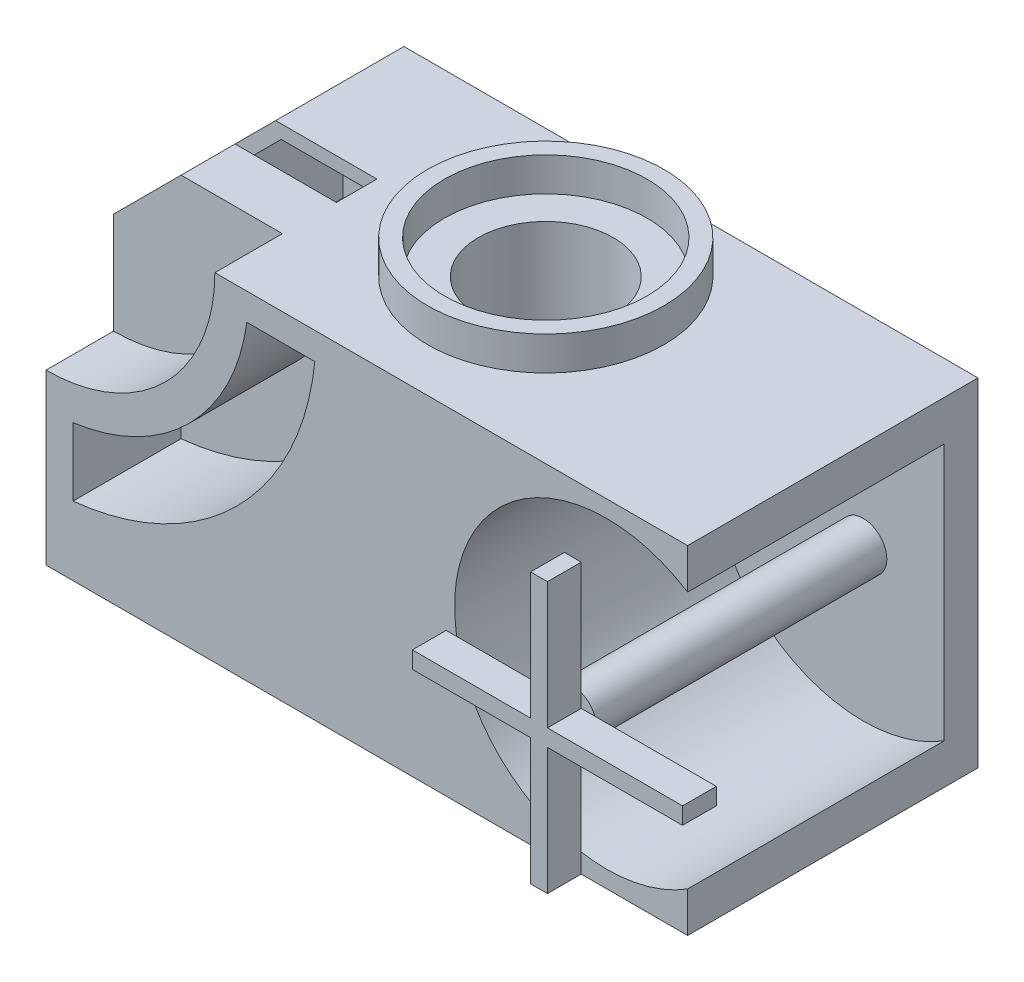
ISO-10303-21;
HEADER;
FILE_DESCRIPTION(('STEP AP214'),'2;1');
FILE_NAME('part.step','',(''),(''),'','','');
FILE_SCHEMA(('AUTOMOTIVE_DESIGN { 1 0 10303 214 1 1 1 1 }'));
ENDSEC;
DATA;
#1=APPLICATION_CONTEXT('core data for automotive mechanical design processes');
#2=APPLICATION_PROTOCOL_DEFINITION('international standard','automotive_design',2000,#1);
#3=PRODUCT_CONTEXT('',#1,'mechanical');
#4=PRODUCT('Part','Part','',(#3));
#5=PRODUCT_RELATED_PRODUCT_CATEGORY('part','',(#4));
#6=PRODUCT_DEFINITION_FORMATION('','',#4);
#7=PRODUCT_DEFINITION_CONTEXT('part definition',#1,'design');
#8=PRODUCT_DEFINITION('design','',#6,#7);
#9=PRODUCT_DEFINITION_SHAPE('','',#8);
#10=(LENGTH_UNIT() NAMED_UNIT(*) SI_UNIT(.MILLI.,.METRE.));
#11=(NAMED_UNIT(*) PLANE_ANGLE_UNIT() SI_UNIT($,.RADIAN.));
#12=(NAMED_UNIT(*) SI_UNIT($,.STERADIAN.) SOLID_ANGLE_UNIT());
#13=UNCERTAINTY_MEASURE_WITH_UNIT(LENGTH_MEASURE(1.E-05),#10,'distance_accuracy_value','');
#14=(GEOMETRIC_REPRESENTATION_CONTEXT(3) GLOBAL_UNCERTAINTY_ASSIGNED_CONTEXT((#13)) GLOBAL_UNIT_ASSIGNED_CONTEXT((#10,
#11,#12)) REPRESENTATION_CONTEXT('',''));
#15=CARTESIAN_POINT('',(0.,0.,0.));
#16=DIRECTION('',(0.,0.,1.));
#17=DIRECTION('',(1.,0.,0.));
#18=AXIS2_PLACEMENT_3D('',#15,#16,#17);
#19=CARTESIAN_POINT('',(0.,50.,144.557514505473));
#20=DIRECTION('',(0.,0.,-1.));
#21=DIRECTION('',(-1.,0.,0.));
#22=AXIS2_PLACEMENT_3D('',#19,#20,#21);
#23=CYLINDRICAL_SURFACE('',#22,25.);
#24=DIRECTION('',(0.,0.,-1.));
#25=VECTOR('',#24,1.);
#26=CARTESIAN_POINT('',(0.,25.,144.557514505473));
#27=LINE('',#26,#25);
#28=CARTESIAN_POINT('',(0.,25.,-18.));
#29=VERTEX_POINT('',#28);
#30=CARTESIAN_POINT('',(0.,25.,-24.));
#31=VERTEX_POINT('',#30);
#32=EDGE_CURVE('E323',#29,#31,#27,.T.);
#33=ORIENTED_EDGE('',*,*,#32,.F.);
#34=CARTESIAN_POINT('',(0.,50.,-18.));
#35=DIRECTION('',(0.,0.,1.));
#36=DIRECTION('',(1.,0.,0.));
#37=AXIS2_PLACEMENT_3D('',#34,#35,#36);
#38=CIRCLE('',#37,25.);
#39=CARTESIAN_POINT('',(25.,50.,-18.));
#40=VERTEX_POINT('',#39);
#41=EDGE_CURVE('E555',#29,#40,#38,.T.);
#42=ORIENTED_EDGE('',*,*,#41,.T.);
#43=DIRECTION('',(0.,0.,-1.));
#44=VECTOR('',#43,1.);
#45=CARTESIAN_POINT('',(25.,50.,144.557514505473));
#46=LINE('',#45,#44);
#47=CARTESIAN_POINT('',(25.,50.,-24.));
#48=VERTEX_POINT('',#47);
#49=EDGE_CURVE('E324',#40,#48,#46,.T.);
#50=ORIENTED_EDGE('',*,*,#49,.T.);
#51=CARTESIAN_POINT('',(0.,50.,-24.));
#52=DIRECTION('',(0.,0.,1.));
#53=DIRECTION('',(1.,0.,0.));
#54=AXIS2_PLACEMENT_3D('',#51,#52,#53);
#55=CIRCLE('',#54,25.);
#56=EDGE_CURVE('E330',#31,#48,#55,.T.);
#57=ORIENTED_EDGE('',*,*,#56,.F.);
#58=EDGE_LOOP('',(#33,#42,#50,#57));
#59=FACE_BOUND('',#58,.T.);
#60=ADVANCED_FACE('F51',(#59),#23,.F.);
#61=CARTESIAN_POINT('',(95.,50.,-43.));
#62=DIRECTION('',(0.,1.,0.));
#63=DIRECTION('',(-1.,0.,0.));
#64=AXIS2_PLACEMENT_3D('',#61,#62,#63);
#65=PLANE('',#64);
#66=CARTESIAN_POINT('',(50.,50.,-24.));
#67=DIRECTION('',(0.,1.,0.));
#68=DIRECTION('',(-1.,0.,0.));
#69=AXIS2_PLACEMENT_3D('',#66,#67,#68);
#70=CIRCLE('',#69,10.);
#71=CARTESIAN_POINT('',(40.,50.,-24.));
#72=VERTEX_POINT('',#71);
#73=EDGE_CURVE('E442',#72,#72,#70,.T.);
#74=ORIENTED_EDGE('',*,*,#73,.F.);
#75=EDGE_LOOP('',(#74));
#76=FACE_BOUND('',#75,.T.);
#77=CARTESIAN_POINT('',(50.,50.,-24.));
#78=DIRECTION('',(0.,1.,0.));
#79=DIRECTION('',(-1.,0.,0.));
#80=AXIS2_PLACEMENT_3D('',#77,#78,#79);
#81=CIRCLE('',#80,15.);
#82=CARTESIAN_POINT('',(35.,50.,-24.));
#83=VERTEX_POINT('',#82);
#84=EDGE_CURVE('E12',#83,#83,#81,.F.);
#85=ORIENTED_EDGE('',*,*,#84,.F.);
#86=EDGE_LOOP('',(#85));
#87=FACE_BOUND('',#86,.T.);
#88=ADVANCED_FACE('F807',(#76,#87),#65,.T.);
#89=CARTESIAN_POINT('',(0.,0.,5.));
#90=DIRECTION('',(0.,0.,1.));
#91=DIRECTION('',(1.,0.,0.));
#92=AXIS2_PLACEMENT_3D('',#89,#90,#91);
#93=PLANE('',#92);
#94=CARTESIAN_POINT('',(83.,25.,5.));
#95=DIRECTION('',(0.,0.,1.));
#96=DIRECTION('',(1.,0.,0.));
#97=AXIS2_PLACEMENT_3D('',#94,#95,#96);
#98=CIRCLE('',#97,3.50000000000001);
#99=CARTESIAN_POINT('',(79.7308257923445,23.75,5.));
#100=VERTEX_POINT('',#99);
#101=CARTESIAN_POINT('',(81.75,21.7308257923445,5.));
#102=VERTEX_POINT('',#101);
#103=EDGE_CURVE('E662',#100,#102,#98,.T.);
#104=ORIENTED_EDGE('',*,*,#103,.T.);
#105=DIRECTION('',(0.,1.,0.));
#106=VECTOR('',#105,1.);
#107=CARTESIAN_POINT('',(81.75,0.,5.));
#108=LINE('',#107,#106);
#109=CARTESIAN_POINT('',(81.75,23.75,5.));
#110=VERTEX_POINT('',#109);
#111=EDGE_CURVE('E61',#102,#110,#108,.T.);
#112=ORIENTED_EDGE('',*,*,#111,.T.);
#113=DIRECTION('',(-1.,0.,0.));
#114=VECTOR('',#113,1.);
#115=CARTESIAN_POINT('',(0.,23.75,5.));
#116=LINE('',#115,#114);
#117=EDGE_CURVE('E721',#110,#100,#116,.T.);
#118=ORIENTED_EDGE('',*,*,#117,.T.);
#119=EDGE_LOOP('',(#104,#112,#118));
#120=FACE_BOUND('',#119,.T.);
#121=ADVANCED_FACE('F764',(#120),#93,.T.);
#122=DIRECTION('',(-1.,0.,0.));
#123=VECTOR('',#122,1.);
#124=CARTESIAN_POINT('',(0.,26.25,5.));
#125=LINE('',#124,#123);
#126=CARTESIAN_POINT('',(81.75,26.25,5.));
#127=VERTEX_POINT('',#126);
#128=CARTESIAN_POINT('',(79.7308257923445,26.25,5.));
#129=VERTEX_POINT('',#128);
#130=EDGE_CURVE('E731',#127,#129,#125,.T.);
#131=ORIENTED_EDGE('',*,*,#130,.F.);
#132=DIRECTION('',(0.,1.,0.));
#133=VECTOR('',#132,1.);
#134=CARTESIAN_POINT('',(81.75,0.,5.));
#135=LINE('',#134,#133);
#136=CARTESIAN_POINT('',(81.75,28.2691742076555,5.));
#137=VERTEX_POINT('',#136);
#138=EDGE_CURVE('E738',#127,#137,#135,.T.);
#139=ORIENTED_EDGE('',*,*,#138,.T.);
#140=EDGE_CURVE('E657',#137,#129,#98,.T.);
#141=ORIENTED_EDGE('',*,*,#140,.T.);
#142=EDGE_LOOP('',(#131,#139,#141));
#143=FACE_BOUND('',#142,.T.);
#144=ADVANCED_FACE('F845',(#143),#93,.T.);
#145=DIRECTION('',(0.,1.,0.));
#146=VECTOR('',#145,1.);
#147=CARTESIAN_POINT('',(84.25,0.,5.));
#148=LINE('',#147,#146);
#149=CARTESIAN_POINT('',(84.25,26.25,5.));
#150=VERTEX_POINT('',#149);
#151=CARTESIAN_POINT('',(84.25,28.2691742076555,5.));
#152=VERTEX_POINT('',#151);
#153=EDGE_CURVE('E747',#150,#152,#148,.T.);
#154=ORIENTED_EDGE('',*,*,#153,.F.);
#155=DIRECTION('',(-1.,0.,0.));
#156=VECTOR('',#155,1.);
#157=CARTESIAN_POINT('',(0.,26.25,5.));
#158=LINE('',#157,#156);
#159=CARTESIAN_POINT('',(86.2691742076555,26.25,5.));
#160=VERTEX_POINT('',#159);
#161=EDGE_CURVE('E422',#160,#150,#158,.T.);
#162=ORIENTED_EDGE('',*,*,#161,.F.);
#163=EDGE_CURVE('E587',#160,#152,#98,.T.);
#164=ORIENTED_EDGE('',*,*,#163,.T.);
#165=EDGE_LOOP('',(#154,#162,#164));
#166=FACE_BOUND('',#165,.T.);
#167=ADVANCED_FACE('F841',(#166),#93,.T.);
#168=CARTESIAN_POINT('',(0.,50.,-43.));
#169=DIRECTION('',(-1.,0.,0.));
#170=DIRECTION('',(0.,0.,1.));
#171=AXIS2_PLACEMENT_3D('',#168,#169,#170);
#172=PLANE('',#171);
#173=DIRECTION('',(0.,-1.,0.));
#174=VECTOR('',#173,1.);
#175=CARTESIAN_POINT('',(0.,50.,-24.));
#176=LINE('',#175,#174);
#177=CARTESIAN_POINT('',(0.,39.9999999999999,-24.));
#178=VERTEX_POINT('',#177);
#179=EDGE_CURVE('E338',#178,#31,#176,.T.);
#180=ORIENTED_EDGE('',*,*,#179,.F.);
#181=DIRECTION('',(0.,0.,-1.));
#182=VECTOR('',#181,1.);
#183=CARTESIAN_POINT('',(0.,39.9999999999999,-43.));
#184=LINE('',#183,#182);
#185=CARTESIAN_POINT('',(0.,39.9999999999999,-43.));
#186=VERTEX_POINT('',#185);
#187=EDGE_CURVE('E392',#178,#186,#184,.T.);
#188=ORIENTED_EDGE('',*,*,#187,.T.);
#189=DIRECTION('',(0.,-1.,0.));
#190=VECTOR('',#189,1.);
#191=CARTESIAN_POINT('',(0.,50.,-43.));
#192=LINE('',#191,#190);
#193=CARTESIAN_POINT('',(0.,0.,-43.));
#194=VERTEX_POINT('',#193);
#195=EDGE_CURVE('E347',#186,#194,#192,.T.);
#196=ORIENTED_EDGE('',*,*,#195,.T.);
#197=DIRECTION('',(0.,0.,1.));
#198=VECTOR('',#197,1.);
#199=CARTESIAN_POINT('',(0.,0.,-43.));
#200=LINE('',#199,#198);
#201=CARTESIAN_POINT('',(0.,0.,0.));
#202=VERTEX_POINT('',#201);
#203=EDGE_CURVE('E361',#194,#202,#200,.T.);
#204=ORIENTED_EDGE('',*,*,#203,.T.);
#205=DIRECTION('',(0.,-1.,0.));
#206=VECTOR('',#205,1.);
#207=CARTESIAN_POINT('',(0.,50.,0.));
#208=LINE('',#207,#206);
#209=CARTESIAN_POINT('',(0.,25.,0.));
#210=VERTEX_POINT('',#209);
#211=EDGE_CURVE('E337',#210,#202,#208,.T.);
#212=ORIENTED_EDGE('',*,*,#211,.F.);
#213=CARTESIAN_POINT('',(0.,25.,-10.));
#214=VERTEX_POINT('',#213);
#215=EDGE_CURVE('E328',#210,#214,#27,.T.);
#216=ORIENTED_EDGE('',*,*,#215,.T.);
#217=DIRECTION('',(0.,-1.,0.));
#218=VECTOR('',#217,1.);
#219=CARTESIAN_POINT('',(0.,39.9999999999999,-10.));
#220=LINE('',#219,#218);
#221=CARTESIAN_POINT('',(0.,39.9999999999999,-10.));
#222=VERTEX_POINT('',#221);
#223=EDGE_CURVE('E313',#222,#214,#220,.T.);
#224=ORIENTED_EDGE('',*,*,#223,.F.);
#225=DIRECTION('',(0.,0.,-1.));
#226=VECTOR('',#225,1.);
#227=CARTESIAN_POINT('',(0.,39.9999999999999,-10.));
#228=LINE('',#227,#226);
#229=CARTESIAN_POINT('',(0.,39.9999999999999,-18.));
#230=VERTEX_POINT('',#229);
#231=EDGE_CURVE('E544',#222,#230,#228,.T.);
#232=ORIENTED_EDGE('',*,*,#231,.T.);
#233=DIRECTION('',(0.,-1.,0.));
#234=VECTOR('',#233,1.);
#235=CARTESIAN_POINT('',(0.,39.9999999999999,-18.));
#236=LINE('',#235,#234);
#237=EDGE_CURVE('E318',#230,#29,#236,.T.);
#238=ORIENTED_EDGE('',*,*,#237,.T.);
#239=ORIENTED_EDGE('',*,*,#32,.T.);
#240=EDGE_LOOP('',(#180,#188,#196,#204,#212,#216,#224,#232,#238,#239));
#241=FACE_BOUND('',#240,.T.);
#242=ADVANCED_FACE('F567',(#241),#172,.T.);
#243=CARTESIAN_POINT('',(0.,0.,0.));
#244=DIRECTION('',(0.,0.,1.));
#245=DIRECTION('',(1.,0.,0.));
#246=AXIS2_PLACEMENT_3D('',#243,#244,#245);
#247=PLANE('',#246);
#248=CARTESIAN_POINT('',(83.,25.,0.));
#249=DIRECTION('',(0.,0.,1.));
#250=DIRECTION('',(1.,0.,0.));
#251=AXIS2_PLACEMENT_3D('',#248,#249,#250);
#252=CIRCLE('',#251,22.5);
#253=CARTESIAN_POINT('',(95.,44.0328663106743,0.));
#254=VERTEX_POINT('',#253);
#255=CARTESIAN_POINT('',(95.,5.9671336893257,0.));
#256=VERTEX_POINT('',#255);
#257=EDGE_CURVE('E583',#254,#256,#252,.T.);
#258=ORIENTED_EDGE('',*,*,#257,.F.);
#259=DIRECTION('',(0.,1.,0.));
#260=VECTOR('',#259,1.);
#261=CARTESIAN_POINT('',(95.,0.,0.));
#262=LINE('',#261,#260);
#263=CARTESIAN_POINT('',(95.,50.,0.));
#264=VERTEX_POINT('',#263);
#265=EDGE_CURVE('E368',#254,#264,#262,.T.);
#266=ORIENTED_EDGE('',*,*,#265,.T.);
#267=DIRECTION('',(-1.,0.,0.));
#268=VECTOR('',#267,1.);
#269=CARTESIAN_POINT('',(95.,50.,0.));
#270=LINE('',#269,#268);
#271=CARTESIAN_POINT('',(25.,50.,0.));
#272=VERTEX_POINT('',#271);
#273=EDGE_CURVE('E351',#264,#272,#270,.T.);
#274=ORIENTED_EDGE('',*,*,#273,.T.);
#275=CARTESIAN_POINT('',(0.,50.,0.));
#276=DIRECTION('',(0.,0.,1.));
#277=DIRECTION('',(1.,0.,0.));
#278=AXIS2_PLACEMENT_3D('',#275,#276,#277);
#279=CIRCLE('',#278,25.);
#280=EDGE_CURVE('E321',#210,#272,#279,.T.);
#281=ORIENTED_EDGE('',*,*,#280,.F.);
#282=ORIENTED_EDGE('',*,*,#211,.T.);
#283=DIRECTION('',(1.,0.,0.));
#284=VECTOR('',#283,1.);
#285=CARTESIAN_POINT('',(63.639702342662,0.,0.));
#286=LINE('',#285,#284);
#287=CARTESIAN_POINT('',(95.,0.,0.));
#288=VERTEX_POINT('',#287);
#289=EDGE_CURVE('E364',#202,#288,#286,.T.);
#290=ORIENTED_EDGE('',*,*,#289,.T.);
#291=EDGE_CURVE('E369',#288,#256,#262,.T.);
#292=ORIENTED_EDGE('',*,*,#291,.T.);
#293=EDGE_LOOP('',(#258,#266,#274,#281,#282,#290,#292));
#294=FACE_BOUND('',#293,.T.);
#295=CARTESIAN_POINT('',(0.,50.,0.));
#296=DIRECTION('',(0.,0.,-1.));
#297=DIRECTION('',(1.,0.,0.));
#298=AXIS2_PLACEMENT_3D('',#295,#296,#297);
#299=CIRCLE('',#298,30.);
#300=CARTESIAN_POINT('',(29.732137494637,46.,0.));
#301=VERTEX_POINT('',#300);
#302=CARTESIAN_POINT('',(4.,20.267862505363,0.));
#303=VERTEX_POINT('',#302);
#304=EDGE_CURVE('E645',#301,#303,#299,.T.);
#305=ORIENTED_EDGE('',*,*,#304,.F.);
#306=DIRECTION('',(-1.,0.,0.));
#307=VECTOR('',#306,1.);
#308=CARTESIAN_POINT('',(29.732137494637,46.,0.));
#309=LINE('',#308,#307);
#310=CARTESIAN_POINT('',(39.7994974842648,46.,0.));
#311=VERTEX_POINT('',#310);
#312=EDGE_CURVE('E633',#311,#301,#309,.T.);
#313=ORIENTED_EDGE('',*,*,#312,.F.);
#314=CARTESIAN_POINT('',(0.,50.,0.));
#315=DIRECTION('',(0.,0.,1.));
#316=DIRECTION('',(-1.,0.,0.));
#317=AXIS2_PLACEMENT_3D('',#314,#315,#316);
#318=CIRCLE('',#317,40.);
#319=CARTESIAN_POINT('',(4.,10.2005025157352,0.));
#320=VERTEX_POINT('',#319);
#321=EDGE_CURVE('E637',#320,#311,#318,.T.);
#322=ORIENTED_EDGE('',*,*,#321,.F.);
#323=DIRECTION('',(0.,-1.,0.));
#324=VECTOR('',#323,1.);
#325=CARTESIAN_POINT('',(4.,20.267862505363,0.));
#326=LINE('',#325,#324);
#327=EDGE_CURVE('E641',#303,#320,#326,.T.);
#328=ORIENTED_EDGE('',*,*,#327,.F.);
#329=EDGE_LOOP('',(#305,#313,#322,#328));
#330=FACE_BOUND('',#329,.T.);
#331=ADVANCED_FACE('F572',(#294,#330),#247,.T.);
#332=CARTESIAN_POINT('',(50.,50.,-24.));
#333=DIRECTION('',(0.,1.,0.));
#334=DIRECTION('',(-1.,0.,0.));
#335=AXIS2_PLACEMENT_3D('',#332,#333,#334);
#336=CIRCLE('',#335,17.5);
#337=CARTESIAN_POINT('',(32.5,50.,-24.));
#338=VERTEX_POINT('',#337);
#339=EDGE_CURVE('E493',#338,#338,#336,.T.);
#340=ORIENTED_EDGE('',*,*,#339,.F.);
#341=EDGE_LOOP('',(#340));
#342=FACE_BOUND('',#341,.T.);
#343=DIRECTION('',(-1.,0.,0.));
#344=VECTOR('',#343,1.);
#345=CARTESIAN_POINT('',(95.,50.,-43.));
#346=LINE('',#345,#344);
#347=CARTESIAN_POINT('',(95.,50.,-43.));
#348=VERTEX_POINT('',#347);
#349=CARTESIAN_POINT('',(10.,50.,-43.));
#350=VERTEX_POINT('',#349);
#351=EDGE_CURVE('E358',#348,#350,#346,.T.);
#352=ORIENTED_EDGE('',*,*,#351,.T.);
#353=DIRECTION('',(0.,0.,1.));
#354=VECTOR('',#353,1.);
#355=CARTESIAN_POINT('',(10.,50.,-43.));
#356=LINE('',#355,#354);
#357=CARTESIAN_POINT('',(10.,50.,-24.));
#358=VERTEX_POINT('',#357);
#359=EDGE_CURVE('E379',#350,#358,#356,.T.);
#360=ORIENTED_EDGE('',*,*,#359,.T.);
#361=DIRECTION('',(-1.,0.,0.));
#362=VECTOR('',#361,1.);
#363=CARTESIAN_POINT('',(95.,50.,-24.));
#364=LINE('',#363,#362);
#365=EDGE_CURVE('E342',#48,#358,#364,.T.);
#366=ORIENTED_EDGE('',*,*,#365,.F.);
#367=ORIENTED_EDGE('',*,*,#49,.F.);
#368=DIRECTION('',(-1.,0.,0.));
#369=VECTOR('',#368,1.);
#370=CARTESIAN_POINT('',(25.,50.,-18.));
#371=LINE('',#370,#369);
#372=CARTESIAN_POINT('',(10.,50.,-18.));
#373=VERTEX_POINT('',#372);
#374=EDGE_CURVE('E68',#40,#373,#371,.T.);
#375=ORIENTED_EDGE('',*,*,#374,.T.);
#376=DIRECTION('',(0.,0.,-1.));
#377=VECTOR('',#376,1.);
#378=CARTESIAN_POINT('',(10.,50.,-10.));
#379=LINE('',#378,#377);
#380=CARTESIAN_POINT('',(10.,50.,-10.));
#381=VERTEX_POINT('',#380);
#382=EDGE_CURVE('E303',#381,#373,#379,.T.);
#383=ORIENTED_EDGE('',*,*,#382,.F.);
#384=DIRECTION('',(-1.,0.,0.));
#385=VECTOR('',#384,1.);
#386=CARTESIAN_POINT('',(25.,50.,-10.));
#387=LINE('',#386,#385);
#388=CARTESIAN_POINT('',(25.,50.,-10.));
#389=VERTEX_POINT('',#388);
#390=EDGE_CURVE('E294',#389,#381,#387,.T.);
#391=ORIENTED_EDGE('',*,*,#390,.F.);
#392=EDGE_CURVE('E300',#272,#389,#46,.T.);
#393=ORIENTED_EDGE('',*,*,#392,.F.);
#394=ORIENTED_EDGE('',*,*,#273,.F.);
#395=DIRECTION('',(0.,0.,1.));
#396=VECTOR('',#395,1.);
#397=CARTESIAN_POINT('',(95.,50.,-43.));
#398=LINE('',#397,#396);
#399=EDGE_CURVE('E375',#348,#264,#398,.T.);
#400=ORIENTED_EDGE('',*,*,#399,.F.);
#401=EDGE_LOOP('',(#352,#360,#366,#367,#375,#383,#391,#393,#394,#400));
#402=FACE_BOUND('',#401,.T.);
#403=ADVANCED_FACE('F297',(#342,#402),#65,.T.);
#404=CARTESIAN_POINT('',(95.,0.,-43.));
#405=DIRECTION('',(1.,0.,0.));
#406=DIRECTION('',(0.,0.,-1.));
#407=AXIS2_PLACEMENT_3D('',#404,#405,#406);
#408=PLANE('',#407);
#409=DIRECTION('',(0.,0.,1.));
#410=VECTOR('',#409,1.);
#411=CARTESIAN_POINT('',(95.,44.0328663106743,-106.639610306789));
#412=LINE('',#411,#410);
#413=CARTESIAN_POINT('',(95.,44.0328663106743,-38.));
#414=VERTEX_POINT('',#413);
#415=EDGE_CURVE('E405',#414,#254,#412,.T.);
#416=ORIENTED_EDGE('',*,*,#415,.F.);
#417=DIRECTION('',(0.,-1.,0.));
#418=VECTOR('',#417,1.);
#419=CARTESIAN_POINT('',(95.,0.,-38.));
#420=LINE('',#419,#418);
#421=CARTESIAN_POINT('',(95.,5.9671336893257,-38.));
#422=VERTEX_POINT('',#421);
#423=EDGE_CURVE('E398',#414,#422,#420,.T.);
#424=ORIENTED_EDGE('',*,*,#423,.T.);
#425=DIRECTION('',(0.,0.,1.));
#426=VECTOR('',#425,1.);
#427=CARTESIAN_POINT('',(95.,5.96713368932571,-106.639610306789));
#428=LINE('',#427,#426);
#429=EDGE_CURVE('E402',#256,#422,#428,.F.);
#430=ORIENTED_EDGE('',*,*,#429,.F.);
#431=ORIENTED_EDGE('',*,*,#291,.F.);
#432=DIRECTION('',(0.,0.,1.));
#433=VECTOR('',#432,1.);
#434=CARTESIAN_POINT('',(95.,0.,-43.));
#435=LINE('',#434,#433);
#436=CARTESIAN_POINT('',(95.,0.,-43.));
#437=VERTEX_POINT('',#436);
#438=EDGE_CURVE('E380',#437,#288,#435,.T.);
#439=ORIENTED_EDGE('',*,*,#438,.F.);
#440=DIRECTION('',(0.,1.,0.));
#441=VECTOR('',#440,1.);
#442=CARTESIAN_POINT('',(95.,0.,-43.));
#443=LINE('',#442,#441);
#444=EDGE_CURVE('E354',#437,#348,#443,.T.);
#445=ORIENTED_EDGE('',*,*,#444,.T.);
#446=ORIENTED_EDGE('',*,*,#399,.T.);
#447=ORIENTED_EDGE('',*,*,#265,.F.);
#448=EDGE_LOOP('',(#416,#424,#430,#431,#439,#445,#446,#447));
#449=FACE_BOUND('',#448,.T.);
#450=ADVANCED_FACE('F582',(#449),#408,.T.);
#451=CARTESIAN_POINT('',(63.639702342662,0.,-43.));
#452=DIRECTION('',(0.,-1.,0.));
#453=DIRECTION('',(0.,0.,-1.));
#454=AXIS2_PLACEMENT_3D('',#451,#452,#453);
#455=PLANE('',#454);
#456=CARTESIAN_POINT('',(50.,0.,-24.));
#457=DIRECTION('',(0.,1.,0.));
#458=DIRECTION('',(-1.,0.,0.));
#459=AXIS2_PLACEMENT_3D('',#456,#457,#458);
#460=CIRCLE('',#459,10.);
#461=CARTESIAN_POINT('',(40.,0.,-24.));
#462=VERTEX_POINT('',#461);
#463=EDGE_CURVE('E437',#462,#462,#460,.T.);
#464=ORIENTED_EDGE('',*,*,#463,.T.);
#465=EDGE_LOOP('',(#464));
#466=FACE_BOUND('',#465,.T.);
#467=ORIENTED_EDGE('',*,*,#289,.F.);
#468=ORIENTED_EDGE('',*,*,#203,.F.);
#469=DIRECTION('',(1.,0.,0.));
#470=VECTOR('',#469,1.);
#471=CARTESIAN_POINT('',(0.,0.,-43.));
#472=LINE('',#471,#470);
#473=EDGE_CURVE('E350',#194,#437,#472,.T.);
#474=ORIENTED_EDGE('',*,*,#473,.T.);
#475=ORIENTED_EDGE('',*,*,#438,.T.);
#476=EDGE_LOOP('',(#467,#468,#474,#475));
#477=FACE_BOUND('',#476,.T.);
#478=ADVANCED_FACE('F575',(#466,#477),#455,.T.);
#479=CARTESIAN_POINT('',(0.,0.,-43.));
#480=DIRECTION('',(0.,0.,1.));
#481=DIRECTION('',(1.,0.,0.));
#482=AXIS2_PLACEMENT_3D('',#479,#480,#481);
#483=PLANE('',#482);
#484=ORIENTED_EDGE('',*,*,#195,.F.);
#485=DIRECTION('',(-0.707106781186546,-0.707106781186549,0.));
#486=VECTOR('',#485,1.);
#487=CARTESIAN_POINT('',(10.,50.,-43.));
#488=LINE('',#487,#486);
#489=EDGE_CURVE('E395',#186,#350,#488,.F.);
#490=ORIENTED_EDGE('',*,*,#489,.T.);
#491=ORIENTED_EDGE('',*,*,#351,.F.);
#492=ORIENTED_EDGE('',*,*,#444,.F.);
#493=ORIENTED_EDGE('',*,*,#473,.F.);
#494=EDGE_LOOP('',(#484,#490,#491,#492,#493));
#495=FACE_BOUND('',#494,.T.);
#496=ADVANCED_FACE('F819',(#495),#483,.F.);
#497=CARTESIAN_POINT('',(0.,50.,-10.));
#498=DIRECTION('',(0.,0.,1.));
#499=DIRECTION('',(1.,0.,0.));
#500=AXIS2_PLACEMENT_3D('',#497,#498,#499);
#501=CIRCLE('',#500,25.);
#502=EDGE_CURVE('E308',#214,#389,#501,.T.);
#503=ORIENTED_EDGE('',*,*,#502,.F.);
#504=ORIENTED_EDGE('',*,*,#215,.F.);
#505=ORIENTED_EDGE('',*,*,#280,.T.);
#506=ORIENTED_EDGE('',*,*,#392,.T.);
#507=EDGE_LOOP('',(#503,#504,#505,#506));
#508=FACE_BOUND('',#507,.T.);
#509=ADVANCED_FACE('F320',(#508),#23,.F.);
#510=CARTESIAN_POINT('',(0.,0.,-24.));
#511=DIRECTION('',(0.,0.,1.));
#512=DIRECTION('',(1.,0.,0.));
#513=AXIS2_PLACEMENT_3D('',#510,#511,#512);
#514=PLANE('',#513);
#515=CARTESIAN_POINT('',(0.,50.,-24.));
#516=DIRECTION('',(0.,0.,1.));
#517=DIRECTION('',(1.,0.,0.));
#518=AXIS2_PLACEMENT_3D('',#515,#516,#517);
#519=CIRCLE('',#518,23.);
#520=CARTESIAN_POINT('',(2.,27.0871215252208,-24.));
#521=VERTEX_POINT('',#520);
#522=CARTESIAN_POINT('',(22.9128784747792,48.,-24.));
#523=VERTEX_POINT('',#522);
#524=EDGE_CURVE('E76',#521,#523,#519,.T.);
#525=ORIENTED_EDGE('',*,*,#524,.F.);
#526=DIRECTION('',(0.,-1.,0.));
#527=VECTOR('',#526,1.);
#528=CARTESIAN_POINT('',(2.,39.1715728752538,-24.));
#529=LINE('',#528,#527);
#530=CARTESIAN_POINT('',(2.,39.1715728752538,-24.));
#531=VERTEX_POINT('',#530);
#532=EDGE_CURVE('E512',#531,#521,#529,.T.);
#533=ORIENTED_EDGE('',*,*,#532,.F.);
#534=DIRECTION('',(-0.707106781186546,-0.707106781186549,0.));
#535=VECTOR('',#534,1.);
#536=CARTESIAN_POINT('',(10.8284271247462,48.,-24.));
#537=LINE('',#536,#535);
#538=CARTESIAN_POINT('',(10.8284271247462,48.,-24.));
#539=VERTEX_POINT('',#538);
#540=EDGE_CURVE('E525',#539,#531,#537,.T.);
#541=ORIENTED_EDGE('',*,*,#540,.F.);
#542=DIRECTION('',(-1.,0.,0.));
#543=VECTOR('',#542,1.);
#544=CARTESIAN_POINT('',(22.9128784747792,48.,-24.));
#545=LINE('',#544,#543);
#546=EDGE_CURVE('E529',#523,#539,#545,.T.);
#547=ORIENTED_EDGE('',*,*,#546,.F.);
#548=EDGE_LOOP('',(#525,#533,#541,#547));
#549=FACE_BOUND('',#548,.T.);
#550=ORIENTED_EDGE('',*,*,#365,.T.);
#551=DIRECTION('',(0.707106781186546,0.707106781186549,0.));
#552=VECTOR('',#551,1.);
#553=CARTESIAN_POINT('',(-20.,19.9999999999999,-24.));
#554=LINE('',#553,#552);
#555=EDGE_CURVE('E389',#358,#178,#554,.F.);
#556=ORIENTED_EDGE('',*,*,#555,.T.);
#557=ORIENTED_EDGE('',*,*,#179,.T.);
#558=ORIENTED_EDGE('',*,*,#56,.T.);
#559=EDGE_LOOP('',(#550,#556,#557,#558));
#560=FACE_BOUND('',#559,.T.);
#561=ADVANCED_FACE('F598',(#549,#560),#514,.T.);
#562=CARTESIAN_POINT('',(0.,50.,-16.));
#563=DIRECTION('',(0.,0.,1.));
#564=DIRECTION('',(1.,0.,0.));
#565=AXIS2_PLACEMENT_3D('',#562,#563,#564);
#566=CYLINDRICAL_SURFACE('',#565,30.);
#567=ORIENTED_EDGE('',*,*,#304,.T.);
#568=DIRECTION('',(0.,0.,1.));
#569=VECTOR('',#568,1.);
#570=CARTESIAN_POINT('',(4.,20.267862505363,-16.));
#571=LINE('',#570,#569);
#572=CARTESIAN_POINT('',(4.,20.267862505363,-16.));
#573=VERTEX_POINT('',#572);
#574=EDGE_CURVE('E614',#573,#303,#571,.T.);
#575=ORIENTED_EDGE('',*,*,#574,.F.);
#576=CARTESIAN_POINT('',(0.,50.,-16.));
#577=DIRECTION('',(0.,0.,-1.));
#578=DIRECTION('',(1.,0.,0.));
#579=AXIS2_PLACEMENT_3D('',#576,#577,#578);
#580=CIRCLE('',#579,30.);
#581=CARTESIAN_POINT('',(29.732137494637,46.,-16.));
#582=VERTEX_POINT('',#581);
#583=EDGE_CURVE('E629',#582,#573,#580,.T.);
#584=ORIENTED_EDGE('',*,*,#583,.F.);
#585=DIRECTION('',(0.,0.,1.));
#586=VECTOR('',#585,1.);
#587=CARTESIAN_POINT('',(29.732137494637,46.,-16.));
#588=LINE('',#587,#586);
#589=EDGE_CURVE('E343',#582,#301,#588,.T.);
#590=ORIENTED_EDGE('',*,*,#589,.T.);
#591=EDGE_LOOP('',(#567,#575,#584,#590));
#592=FACE_BOUND('',#591,.T.);
#593=ADVANCED_FACE('F825',(#592),#566,.T.);
#594=CARTESIAN_POINT('',(29.732137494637,46.,-16.));
#595=DIRECTION('',(0.,1.,0.));
#596=DIRECTION('',(0.,0.,1.));
#597=AXIS2_PLACEMENT_3D('',#594,#595,#596);
#598=PLANE('',#597);
#599=ORIENTED_EDGE('',*,*,#312,.T.);
#600=ORIENTED_EDGE('',*,*,#589,.F.);
#601=DIRECTION('',(-1.,0.,0.));
#602=VECTOR('',#601,1.);
#603=CARTESIAN_POINT('',(29.732137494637,46.,-16.));
#604=LINE('',#603,#602);
#605=CARTESIAN_POINT('',(39.7994974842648,46.,-16.));
#606=VERTEX_POINT('',#605);
#607=EDGE_CURVE('E618',#606,#582,#604,.T.);
#608=ORIENTED_EDGE('',*,*,#607,.F.);
#609=DIRECTION('',(0.,0.,1.));
#610=VECTOR('',#609,1.);
#611=CARTESIAN_POINT('',(39.7994974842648,46.,-16.));
#612=LINE('',#611,#610);
#613=EDGE_CURVE('E608',#606,#311,#612,.T.);
#614=ORIENTED_EDGE('',*,*,#613,.T.);
#615=EDGE_LOOP('',(#599,#600,#608,#614));
#616=FACE_BOUND('',#615,.T.);
#617=ADVANCED_FACE('F942',(#616),#598,.F.);
#618=CARTESIAN_POINT('',(0.,50.,-16.));
#619=DIRECTION('',(0.,0.,1.));
#620=DIRECTION('',(1.,0.,0.));
#621=AXIS2_PLACEMENT_3D('',#618,#619,#620);
#622=CYLINDRICAL_SURFACE('',#621,40.);
#623=ORIENTED_EDGE('',*,*,#321,.T.);
#624=ORIENTED_EDGE('',*,*,#613,.F.);
#625=CARTESIAN_POINT('',(0.,50.,-16.));
#626=DIRECTION('',(0.,0.,1.));
#627=DIRECTION('',(-1.,0.,0.));
#628=AXIS2_PLACEMENT_3D('',#625,#626,#627);
#629=CIRCLE('',#628,40.);
#630=CARTESIAN_POINT('',(4.,10.2005025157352,-16.));
#631=VERTEX_POINT('',#630);
#632=EDGE_CURVE('E621',#631,#606,#629,.T.);
#633=ORIENTED_EDGE('',*,*,#632,.F.);
#634=DIRECTION('',(0.,0.,1.));
#635=VECTOR('',#634,1.);
#636=CARTESIAN_POINT('',(4.,10.2005025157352,-16.));
#637=LINE('',#636,#635);
#638=EDGE_CURVE('E611',#631,#320,#637,.T.);
#639=ORIENTED_EDGE('',*,*,#638,.T.);
#640=EDGE_LOOP('',(#623,#624,#633,#639));
#641=FACE_BOUND('',#640,.T.);
#642=ADVANCED_FACE('F932',(#641),#622,.F.);
#643=CARTESIAN_POINT('',(4.,20.267862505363,-16.));
#644=DIRECTION('',(-1.,0.,0.));
#645=DIRECTION('',(0.,-1.,0.));
#646=AXIS2_PLACEMENT_3D('',#643,#644,#645);
#647=PLANE('',#646);
#648=ORIENTED_EDGE('',*,*,#327,.T.);
#649=ORIENTED_EDGE('',*,*,#638,.F.);
#650=DIRECTION('',(0.,-1.,0.));
#651=VECTOR('',#650,1.);
#652=CARTESIAN_POINT('',(4.,20.267862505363,-16.));
#653=LINE('',#652,#651);
#654=EDGE_CURVE('E625',#573,#631,#653,.T.);
#655=ORIENTED_EDGE('',*,*,#654,.F.);
#656=ORIENTED_EDGE('',*,*,#574,.T.);
#657=EDGE_LOOP('',(#648,#649,#655,#656));
#658=FACE_BOUND('',#657,.T.);
#659=ADVANCED_FACE('F922',(#658),#647,.F.);
#660=CARTESIAN_POINT('',(0.,50.,-16.));
#661=DIRECTION('',(0.,0.,1.));
#662=DIRECTION('',(1.,0.,0.));
#663=AXIS2_PLACEMENT_3D('',#660,#661,#662);
#664=PLANE('',#663);
#665=ORIENTED_EDGE('',*,*,#583,.T.);
#666=ORIENTED_EDGE('',*,*,#654,.T.);
#667=ORIENTED_EDGE('',*,*,#632,.T.);
#668=ORIENTED_EDGE('',*,*,#607,.T.);
#669=EDGE_LOOP('',(#665,#666,#667,#668));
#670=FACE_BOUND('',#669,.T.);
#671=ADVANCED_FACE('F915',(#670),#664,.T.);
#672=CARTESIAN_POINT('',(10.,50.,-43.));
#673=DIRECTION('',(0.707106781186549,-0.707106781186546,0.));
#674=DIRECTION('',(0.,0.,1.));
#675=AXIS2_PLACEMENT_3D('',#672,#673,#674);
#676=PLANE('',#675);
#677=ORIENTED_EDGE('',*,*,#489,.F.);
#678=ORIENTED_EDGE('',*,*,#187,.F.);
#679=ORIENTED_EDGE('',*,*,#555,.F.);
#680=ORIENTED_EDGE('',*,*,#359,.F.);
#681=EDGE_LOOP('',(#677,#678,#679,#680));
#682=FACE_BOUND('',#681,.T.);
#683=ADVANCED_FACE('F54',(#682),#676,.F.);
#684=CARTESIAN_POINT('',(83.,25.,-106.639610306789));
#685=DIRECTION('',(0.,0.,1.));
#686=DIRECTION('',(1.,0.,0.));
#687=AXIS2_PLACEMENT_3D('',#684,#685,#686);
#688=CYLINDRICAL_SURFACE('',#687,22.5);
#689=ORIENTED_EDGE('',*,*,#415,.T.);
#690=ORIENTED_EDGE('',*,*,#257,.T.);
#691=ORIENTED_EDGE('',*,*,#429,.T.);
#692=CARTESIAN_POINT('',(83.,25.,-38.));
#693=DIRECTION('',(0.,0.,1.));
#694=DIRECTION('',(1.,0.,0.));
#695=AXIS2_PLACEMENT_3D('',#692,#693,#694);
#696=CIRCLE('',#695,22.5);
#697=EDGE_CURVE('E586',#422,#414,#696,.F.);
#698=ORIENTED_EDGE('',*,*,#697,.T.);
#699=EDGE_LOOP('',(#689,#690,#691,#698));
#700=FACE_BOUND('',#699,.T.);
#701=ADVANCED_FACE('F901',(#700),#688,.F.);
#702=CARTESIAN_POINT('',(0.,0.,-38.));
#703=DIRECTION('',(0.,0.,1.));
#704=DIRECTION('',(1.,0.,0.));
#705=AXIS2_PLACEMENT_3D('',#702,#703,#704);
#706=PLANE('',#705);
#707=CARTESIAN_POINT('',(83.,25.,-38.));
#708=DIRECTION('',(0.,0.,1.));
#709=DIRECTION('',(1.,0.,0.));
#710=AXIS2_PLACEMENT_3D('',#707,#708,#709);
#711=CIRCLE('',#710,3.50000000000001);
#712=CARTESIAN_POINT('',(86.5,25.,-38.));
#713=VERTEX_POINT('',#712);
#714=EDGE_CURVE('E670',#713,#713,#711,.T.);
#715=ORIENTED_EDGE('',*,*,#714,.F.);
#716=EDGE_LOOP('',(#715));
#717=FACE_BOUND('',#716,.T.);
#718=ORIENTED_EDGE('',*,*,#697,.F.);
#719=ORIENTED_EDGE('',*,*,#423,.F.);
#720=EDGE_LOOP('',(#718,#719));
#721=FACE_BOUND('',#720,.T.);
#722=ADVANCED_FACE('F864',(#717,#721),#706,.T.);
#723=CARTESIAN_POINT('',(83.,25.,19.8994949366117));
#724=DIRECTION('',(0.,0.,-1.));
#725=DIRECTION('',(-1.,0.,0.));
#726=AXIS2_PLACEMENT_3D('',#723,#724,#725);
#727=CYLINDRICAL_SURFACE('',#726,3.50000000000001);
#728=ORIENTED_EDGE('',*,*,#714,.T.);
#729=EDGE_LOOP('',(#728));
#730=FACE_BOUND('',#729,.T.);
#731=ORIENTED_EDGE('',*,*,#163,.F.);
#732=CARTESIAN_POINT('',(86.2691742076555,23.75,5.));
#733=VERTEX_POINT('',#732);
#734=EDGE_CURVE('E655',#733,#160,#98,.T.);
#735=ORIENTED_EDGE('',*,*,#734,.F.);
#736=CARTESIAN_POINT('',(84.25,21.7308257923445,5.));
#737=VERTEX_POINT('',#736);
#738=EDGE_CURVE('E667',#737,#733,#98,.T.);
#739=ORIENTED_EDGE('',*,*,#738,.F.);
#740=EDGE_CURVE('E665',#102,#737,#98,.T.);
#741=ORIENTED_EDGE('',*,*,#740,.F.);
#742=ORIENTED_EDGE('',*,*,#103,.F.);
#743=EDGE_CURVE('E660',#129,#100,#98,.T.);
#744=ORIENTED_EDGE('',*,*,#743,.F.);
#745=ORIENTED_EDGE('',*,*,#140,.F.);
#746=EDGE_CURVE('E653',#152,#137,#98,.T.);
#747=ORIENTED_EDGE('',*,*,#746,.F.);
#748=EDGE_LOOP('',(#731,#735,#739,#741,#742,#744,#745,#747));
#749=FACE_BOUND('',#748,.T.);
#750=ADVANCED_FACE('F777',(#730,#749),#727,.T.);
#751=DIRECTION('',(0.,1.,0.));
#752=VECTOR('',#751,1.);
#753=CARTESIAN_POINT('',(84.25,0.,5.));
#754=LINE('',#753,#752);
#755=CARTESIAN_POINT('',(84.25,23.75,5.));
#756=VERTEX_POINT('',#755);
#757=EDGE_CURVE('E414',#737,#756,#754,.T.);
#758=ORIENTED_EDGE('',*,*,#757,.F.);
#759=ORIENTED_EDGE('',*,*,#738,.T.);
#760=DIRECTION('',(-1.,0.,0.));
#761=VECTOR('',#760,1.);
#762=CARTESIAN_POINT('',(0.,23.75,5.));
#763=LINE('',#762,#761);
#764=EDGE_CURVE('E407',#733,#756,#763,.T.);
#765=ORIENTED_EDGE('',*,*,#764,.T.);
#766=EDGE_LOOP('',(#758,#759,#765));
#767=FACE_BOUND('',#766,.T.);
#768=ADVANCED_FACE('F779',(#767),#93,.T.);
#769=CARTESIAN_POINT('',(0.,0.,5.));
#770=DIRECTION('',(0.,0.,1.));
#771=DIRECTION('',(1.,0.,0.));
#772=AXIS2_PLACEMENT_3D('',#769,#770,#771);
#773=PLANE('',#772);
#774=CARTESIAN_POINT('',(84.25,45.,5.));
#775=VERTEX_POINT('',#774);
#776=EDGE_CURVE('E751',#152,#775,#148,.T.);
#777=ORIENTED_EDGE('',*,*,#776,.F.);
#778=ORIENTED_EDGE('',*,*,#746,.T.);
#779=CARTESIAN_POINT('',(81.75,45.,5.));
#780=VERTEX_POINT('',#779);
#781=EDGE_CURVE('E741',#137,#780,#135,.T.);
#782=ORIENTED_EDGE('',*,*,#781,.T.);
#783=DIRECTION('',(-1.,0.,0.));
#784=VECTOR('',#783,1.);
#785=CARTESIAN_POINT('',(0.,45.,5.));
#786=LINE('',#785,#784);
#787=EDGE_CURVE('E744',#775,#780,#786,.T.);
#788=ORIENTED_EDGE('',*,*,#787,.F.);
#789=EDGE_LOOP('',(#777,#778,#782,#788));
#790=FACE_BOUND('',#789,.T.);
#791=ADVANCED_FACE('F857',(#790),#773,.F.);
#792=CARTESIAN_POINT('',(64.25,26.25,5.));
#793=VERTEX_POINT('',#792);
#794=EDGE_CURVE('E735',#129,#793,#125,.T.);
#795=ORIENTED_EDGE('',*,*,#794,.F.);
#796=ORIENTED_EDGE('',*,*,#743,.T.);
#797=CARTESIAN_POINT('',(64.25,23.75,5.));
#798=VERTEX_POINT('',#797);
#799=EDGE_CURVE('E725',#100,#798,#116,.T.);
#800=ORIENTED_EDGE('',*,*,#799,.T.);
#801=DIRECTION('',(0.,1.,0.));
#802=VECTOR('',#801,1.);
#803=CARTESIAN_POINT('',(64.25,0.,5.));
#804=LINE('',#803,#802);
#805=EDGE_CURVE('E728',#798,#793,#804,.T.);
#806=ORIENTED_EDGE('',*,*,#805,.T.);
#807=EDGE_LOOP('',(#795,#796,#800,#806));
#808=FACE_BOUND('',#807,.T.);
#809=ADVANCED_FACE('F861',(#808),#773,.F.);
#810=CARTESIAN_POINT('',(81.75,5.,5.));
#811=VERTEX_POINT('',#810);
#812=EDGE_CURVE('E717',#811,#102,#108,.T.);
#813=ORIENTED_EDGE('',*,*,#812,.T.);
#814=ORIENTED_EDGE('',*,*,#740,.T.);
#815=CARTESIAN_POINT('',(84.25,5.,5.));
#816=VERTEX_POINT('',#815);
#817=EDGE_CURVE('E424',#816,#737,#754,.T.);
#818=ORIENTED_EDGE('',*,*,#817,.F.);
#819=DIRECTION('',(-1.,0.,0.));
#820=VECTOR('',#819,1.);
#821=CARTESIAN_POINT('',(0.,4.99999999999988,5.));
#822=LINE('',#821,#820);
#823=EDGE_CURVE('E488',#816,#811,#822,.T.);
#824=ORIENTED_EDGE('',*,*,#823,.T.);
#825=EDGE_LOOP('',(#813,#814,#818,#824));
#826=FACE_BOUND('',#825,.T.);
#827=ADVANCED_FACE('F772',(#826),#773,.F.);
#828=CARTESIAN_POINT('',(104.25,23.75,5.));
#829=VERTEX_POINT('',#828);
#830=EDGE_CURVE('E416',#829,#733,#763,.T.);
#831=ORIENTED_EDGE('',*,*,#830,.T.);
#832=ORIENTED_EDGE('',*,*,#734,.T.);
#833=CARTESIAN_POINT('',(104.25,26.25,5.));
#834=VERTEX_POINT('',#833);
#835=EDGE_CURVE('E435',#834,#160,#158,.T.);
#836=ORIENTED_EDGE('',*,*,#835,.F.);
#837=DIRECTION('',(0.,1.,0.));
#838=VECTOR('',#837,1.);
#839=CARTESIAN_POINT('',(104.25,0.,5.));
#840=LINE('',#839,#838);
#841=EDGE_CURVE('E428',#829,#834,#840,.T.);
#842=ORIENTED_EDGE('',*,*,#841,.F.);
#843=EDGE_LOOP('',(#831,#832,#836,#842));
#844=FACE_BOUND('',#843,.T.);
#845=ADVANCED_FACE('F863',(#844),#773,.F.);
#846=CARTESIAN_POINT('',(84.25,0.,10.));
#847=DIRECTION('',(-1.,0.,0.));
#848=DIRECTION('',(0.,-1.,0.));
#849=AXIS2_PLACEMENT_3D('',#846,#847,#848);
#850=PLANE('',#849);
#851=ORIENTED_EDGE('',*,*,#817,.T.);
#852=ORIENTED_EDGE('',*,*,#757,.T.);
#853=DIRECTION('',(0.,0.,-1.));
#854=VECTOR('',#853,1.);
#855=CARTESIAN_POINT('',(84.25,23.75,10.));
#856=LINE('',#855,#854);
#857=CARTESIAN_POINT('',(84.25,23.75,10.));
#858=VERTEX_POINT('',#857);
#859=EDGE_CURVE('E673',#858,#756,#856,.T.);
#860=ORIENTED_EDGE('',*,*,#859,.F.);
#861=DIRECTION('',(0.,1.,0.));
#862=VECTOR('',#861,1.);
#863=CARTESIAN_POINT('',(84.25,0.,10.));
#864=LINE('',#863,#862);
#865=CARTESIAN_POINT('',(84.25,5.,10.));
#866=VERTEX_POINT('',#865);
#867=EDGE_CURVE('E485',#866,#858,#864,.T.);
#868=ORIENTED_EDGE('',*,*,#867,.F.);
#869=DIRECTION('',(0.,0.,-1.));
#870=VECTOR('',#869,1.);
#871=CARTESIAN_POINT('',(84.25,5.,10.));
#872=LINE('',#871,#870);
#873=EDGE_CURVE('E449',#866,#816,#872,.T.);
#874=ORIENTED_EDGE('',*,*,#873,.T.);
#875=EDGE_LOOP('',(#851,#852,#860,#868,#874));
#876=FACE_BOUND('',#875,.T.);
#877=ADVANCED_FACE('F781',(#876),#850,.F.);
#878=CARTESIAN_POINT('',(0.,23.75,10.));
#879=DIRECTION('',(0.,-1.,0.));
#880=DIRECTION('',(1.,0.,0.));
#881=AXIS2_PLACEMENT_3D('',#878,#879,#880);
#882=PLANE('',#881);
#883=ORIENTED_EDGE('',*,*,#830,.F.);
#884=DIRECTION('',(0.,0.,-1.));
#885=VECTOR('',#884,1.);
#886=CARTESIAN_POINT('',(104.25,23.75,10.));
#887=LINE('',#886,#885);
#888=CARTESIAN_POINT('',(104.25,23.75,10.));
#889=VERTEX_POINT('',#888);
#890=EDGE_CURVE('E676',#889,#829,#887,.T.);
#891=ORIENTED_EDGE('',*,*,#890,.F.);
#892=DIRECTION('',(-1.,0.,0.));
#893=VECTOR('',#892,1.);
#894=CARTESIAN_POINT('',(0.,23.75,10.));
#895=LINE('',#894,#893);
#896=EDGE_CURVE('E481',#889,#858,#895,.T.);
#897=ORIENTED_EDGE('',*,*,#896,.T.);
#898=ORIENTED_EDGE('',*,*,#859,.T.);
#899=ORIENTED_EDGE('',*,*,#764,.F.);
#900=EDGE_LOOP('',(#883,#891,#897,#898,#899));
#901=FACE_BOUND('',#900,.T.);
#902=ADVANCED_FACE('F786',(#901),#882,.T.);
#903=CARTESIAN_POINT('',(104.25,0.,10.));
#904=DIRECTION('',(-1.,0.,0.));
#905=DIRECTION('',(0.,0.,1.));
#906=AXIS2_PLACEMENT_3D('',#903,#904,#905);
#907=PLANE('',#906);
#908=ORIENTED_EDGE('',*,*,#841,.T.);
#909=DIRECTION('',(0.,0.,-1.));
#910=VECTOR('',#909,1.);
#911=CARTESIAN_POINT('',(104.25,26.25,10.));
#912=LINE('',#911,#910);
#913=CARTESIAN_POINT('',(104.25,26.25,10.));
#914=VERTEX_POINT('',#913);
#915=EDGE_CURVE('E679',#914,#834,#912,.T.);
#916=ORIENTED_EDGE('',*,*,#915,.F.);
#917=DIRECTION('',(0.,1.,0.));
#918=VECTOR('',#917,1.);
#919=CARTESIAN_POINT('',(104.25,0.,10.));
#920=LINE('',#919,#918);
#921=EDGE_CURVE('E478',#889,#914,#920,.T.);
#922=ORIENTED_EDGE('',*,*,#921,.F.);
#923=ORIENTED_EDGE('',*,*,#890,.T.);
#924=EDGE_LOOP('',(#908,#916,#922,#923));
#925=FACE_BOUND('',#924,.T.);
#926=ADVANCED_FACE('F1229',(#925),#907,.F.);
#927=CARTESIAN_POINT('',(0.,26.25,10.));
#928=DIRECTION('',(0.,-1.,0.));
#929=DIRECTION('',(1.,0.,0.));
#930=AXIS2_PLACEMENT_3D('',#927,#928,#929);
#931=PLANE('',#930);
#932=ORIENTED_EDGE('',*,*,#835,.T.);
#933=ORIENTED_EDGE('',*,*,#161,.T.);
#934=DIRECTION('',(0.,0.,-1.));
#935=VECTOR('',#934,1.);
#936=CARTESIAN_POINT('',(84.25,26.25,10.));
#937=LINE('',#936,#935);
#938=CARTESIAN_POINT('',(84.25,26.25,10.));
#939=VERTEX_POINT('',#938);
#940=EDGE_CURVE('E683',#939,#150,#937,.T.);
#941=ORIENTED_EDGE('',*,*,#940,.F.);
#942=DIRECTION('',(-1.,0.,0.));
#943=VECTOR('',#942,1.);
#944=CARTESIAN_POINT('',(0.,26.25,10.));
#945=LINE('',#944,#943);
#946=EDGE_CURVE('E475',#914,#939,#945,.T.);
#947=ORIENTED_EDGE('',*,*,#946,.F.);
#948=ORIENTED_EDGE('',*,*,#915,.T.);
#949=EDGE_LOOP('',(#932,#933,#941,#947,#948));
#950=FACE_BOUND('',#949,.T.);
#951=ADVANCED_FACE('F1220',(#950),#931,.F.);
#952=CARTESIAN_POINT('',(84.25,0.,10.));
#953=DIRECTION('',(-1.,0.,0.));
#954=DIRECTION('',(0.,-1.,0.));
#955=AXIS2_PLACEMENT_3D('',#952,#953,#954);
#956=PLANE('',#955);
#957=ORIENTED_EDGE('',*,*,#153,.T.);
#958=ORIENTED_EDGE('',*,*,#776,.T.);
#959=DIRECTION('',(0.,0.,-1.));
#960=VECTOR('',#959,1.);
#961=CARTESIAN_POINT('',(84.25,45.,10.));
#962=LINE('',#961,#960);
#963=CARTESIAN_POINT('',(84.25,45.,10.));
#964=VERTEX_POINT('',#963);
#965=EDGE_CURVE('E687',#964,#775,#962,.T.);
#966=ORIENTED_EDGE('',*,*,#965,.F.);
#967=DIRECTION('',(0.,1.,0.));
#968=VECTOR('',#967,1.);
#969=CARTESIAN_POINT('',(84.25,0.,10.));
#970=LINE('',#969,#968);
#971=EDGE_CURVE('E472',#939,#964,#970,.T.);
#972=ORIENTED_EDGE('',*,*,#971,.F.);
#973=ORIENTED_EDGE('',*,*,#940,.T.);
#974=EDGE_LOOP('',(#957,#958,#966,#972,#973));
#975=FACE_BOUND('',#974,.T.);
#976=ADVANCED_FACE('F1211',(#975),#956,.F.);
#977=CARTESIAN_POINT('',(0.,45.,10.));
#978=DIRECTION('',(0.,-1.,0.));
#979=DIRECTION('',(0.,0.,-1.));
#980=AXIS2_PLACEMENT_3D('',#977,#978,#979);
#981=PLANE('',#980);
#982=ORIENTED_EDGE('',*,*,#787,.T.);
#983=DIRECTION('',(0.,0.,-1.));
#984=VECTOR('',#983,1.);
#985=CARTESIAN_POINT('',(81.75,45.,10.));
#986=LINE('',#985,#984);
#987=CARTESIAN_POINT('',(81.75,45.,10.));
#988=VERTEX_POINT('',#987);
#989=EDGE_CURVE('E691',#988,#780,#986,.T.);
#990=ORIENTED_EDGE('',*,*,#989,.F.);
#991=DIRECTION('',(-1.,0.,0.));
#992=VECTOR('',#991,1.);
#993=CARTESIAN_POINT('',(0.,45.,10.));
#994=LINE('',#993,#992);
#995=EDGE_CURVE('E469',#964,#988,#994,.T.);
#996=ORIENTED_EDGE('',*,*,#995,.F.);
#997=ORIENTED_EDGE('',*,*,#965,.T.);
#998=EDGE_LOOP('',(#982,#990,#996,#997));
#999=FACE_BOUND('',#998,.T.);
#1000=ADVANCED_FACE('F1202',(#999),#981,.F.);
#1001=CARTESIAN_POINT('',(81.75,0.,10.));
#1002=DIRECTION('',(-1.,0.,0.));
#1003=DIRECTION('',(0.,-1.,0.));
#1004=AXIS2_PLACEMENT_3D('',#1001,#1002,#1003);
#1005=PLANE('',#1004);
#1006=ORIENTED_EDGE('',*,*,#138,.F.);
#1007=DIRECTION('',(0.,0.,-1.));
#1008=VECTOR('',#1007,1.);
#1009=CARTESIAN_POINT('',(81.75,26.25,10.));
#1010=LINE('',#1009,#1008);
#1011=CARTESIAN_POINT('',(81.75,26.25,10.));
#1012=VERTEX_POINT('',#1011);
#1013=EDGE_CURVE('E695',#1012,#127,#1010,.T.);
#1014=ORIENTED_EDGE('',*,*,#1013,.F.);
#1015=DIRECTION('',(0.,1.,0.));
#1016=VECTOR('',#1015,1.);
#1017=CARTESIAN_POINT('',(81.75,0.,10.));
#1018=LINE('',#1017,#1016);
#1019=EDGE_CURVE('E465',#1012,#988,#1018,.T.);
#1020=ORIENTED_EDGE('',*,*,#1019,.T.);
#1021=ORIENTED_EDGE('',*,*,#989,.T.);
#1022=ORIENTED_EDGE('',*,*,#781,.F.);
#1023=EDGE_LOOP('',(#1006,#1014,#1020,#1021,#1022));
#1024=FACE_BOUND('',#1023,.T.);
#1025=ADVANCED_FACE('F1193',(#1024),#1005,.T.);
#1026=CARTESIAN_POINT('',(0.,26.25,10.));
#1027=DIRECTION('',(0.,-1.,0.));
#1028=DIRECTION('',(1.,0.,0.));
#1029=AXIS2_PLACEMENT_3D('',#1026,#1027,#1028);
#1030=PLANE('',#1029);
#1031=ORIENTED_EDGE('',*,*,#130,.T.);
#1032=ORIENTED_EDGE('',*,*,#794,.T.);
#1033=DIRECTION('',(0.,0.,-1.));
#1034=VECTOR('',#1033,1.);
#1035=CARTESIAN_POINT('',(64.25,26.25,10.));
#1036=LINE('',#1035,#1034);
#1037=CARTESIAN_POINT('',(64.25,26.25,10.));
#1038=VERTEX_POINT('',#1037);
#1039=EDGE_CURVE('E698',#1038,#793,#1036,.T.);
#1040=ORIENTED_EDGE('',*,*,#1039,.F.);
#1041=DIRECTION('',(-1.,0.,0.));
#1042=VECTOR('',#1041,1.);
#1043=CARTESIAN_POINT('',(0.,26.25,10.));
#1044=LINE('',#1043,#1042);
#1045=EDGE_CURVE('E462',#1012,#1038,#1044,.T.);
#1046=ORIENTED_EDGE('',*,*,#1045,.F.);
#1047=ORIENTED_EDGE('',*,*,#1013,.T.);
#1048=EDGE_LOOP('',(#1031,#1032,#1040,#1046,#1047));
#1049=FACE_BOUND('',#1048,.T.);
#1050=ADVANCED_FACE('F1184',(#1049),#1030,.F.);
#1051=CARTESIAN_POINT('',(64.25,0.,10.));
#1052=DIRECTION('',(-1.,0.,0.));
#1053=DIRECTION('',(0.,0.,1.));
#1054=AXIS2_PLACEMENT_3D('',#1051,#1052,#1053);
#1055=PLANE('',#1054);
#1056=ORIENTED_EDGE('',*,*,#805,.F.);
#1057=DIRECTION('',(0.,0.,-1.));
#1058=VECTOR('',#1057,1.);
#1059=CARTESIAN_POINT('',(64.25,23.75,10.));
#1060=LINE('',#1059,#1058);
#1061=CARTESIAN_POINT('',(64.25,23.75,10.));
#1062=VERTEX_POINT('',#1061);
#1063=EDGE_CURVE('E702',#1062,#798,#1060,.T.);
#1064=ORIENTED_EDGE('',*,*,#1063,.F.);
#1065=DIRECTION('',(0.,1.,0.));
#1066=VECTOR('',#1065,1.);
#1067=CARTESIAN_POINT('',(64.25,0.,10.));
#1068=LINE('',#1067,#1066);
#1069=EDGE_CURVE('E458',#1062,#1038,#1068,.T.);
#1070=ORIENTED_EDGE('',*,*,#1069,.T.);
#1071=ORIENTED_EDGE('',*,*,#1039,.T.);
#1072=EDGE_LOOP('',(#1056,#1064,#1070,#1071));
#1073=FACE_BOUND('',#1072,.T.);
#1074=ADVANCED_FACE('F1175',(#1073),#1055,.T.);
#1075=CARTESIAN_POINT('',(0.,23.75,10.));
#1076=DIRECTION('',(0.,-1.,0.));
#1077=DIRECTION('',(1.,0.,0.));
#1078=AXIS2_PLACEMENT_3D('',#1075,#1076,#1077);
#1079=PLANE('',#1078);
#1080=ORIENTED_EDGE('',*,*,#117,.F.);
#1081=DIRECTION('',(0.,0.,-1.));
#1082=VECTOR('',#1081,1.);
#1083=CARTESIAN_POINT('',(81.75,23.75,10.));
#1084=LINE('',#1083,#1082);
#1085=CARTESIAN_POINT('',(81.75,23.75,10.));
#1086=VERTEX_POINT('',#1085);
#1087=EDGE_CURVE('E706',#1086,#110,#1084,.T.);
#1088=ORIENTED_EDGE('',*,*,#1087,.F.);
#1089=DIRECTION('',(-1.,0.,0.));
#1090=VECTOR('',#1089,1.);
#1091=CARTESIAN_POINT('',(0.,23.75,10.));
#1092=LINE('',#1091,#1090);
#1093=EDGE_CURVE('E454',#1086,#1062,#1092,.T.);
#1094=ORIENTED_EDGE('',*,*,#1093,.T.);
#1095=ORIENTED_EDGE('',*,*,#1063,.T.);
#1096=ORIENTED_EDGE('',*,*,#799,.F.);
#1097=EDGE_LOOP('',(#1080,#1088,#1094,#1095,#1096));
#1098=FACE_BOUND('',#1097,.T.);
#1099=ADVANCED_FACE('F803',(#1098),#1079,.T.);
#1100=CARTESIAN_POINT('',(81.75,0.,10.));
#1101=DIRECTION('',(-1.,0.,0.));
#1102=DIRECTION('',(0.,-1.,0.));
#1103=AXIS2_PLACEMENT_3D('',#1100,#1101,#1102);
#1104=PLANE('',#1103);
#1105=ORIENTED_EDGE('',*,*,#812,.F.);
#1106=DIRECTION('',(0.,0.,-1.));
#1107=VECTOR('',#1106,1.);
#1108=CARTESIAN_POINT('',(81.75,5.,10.));
#1109=LINE('',#1108,#1107);
#1110=CARTESIAN_POINT('',(81.75,5.,10.));
#1111=VERTEX_POINT('',#1110);
#1112=EDGE_CURVE('E709',#1111,#811,#1109,.T.);
#1113=ORIENTED_EDGE('',*,*,#1112,.F.);
#1114=DIRECTION('',(0.,1.,0.));
#1115=VECTOR('',#1114,1.);
#1116=CARTESIAN_POINT('',(81.75,0.,10.));
#1117=LINE('',#1116,#1115);
#1118=EDGE_CURVE('E450',#1111,#1086,#1117,.T.);
#1119=ORIENTED_EDGE('',*,*,#1118,.T.);
#1120=ORIENTED_EDGE('',*,*,#1087,.T.);
#1121=ORIENTED_EDGE('',*,*,#111,.F.);
#1122=EDGE_LOOP('',(#1105,#1113,#1119,#1120,#1121));
#1123=FACE_BOUND('',#1122,.T.);
#1124=ADVANCED_FACE('F769',(#1123),#1104,.T.);
#1125=CARTESIAN_POINT('',(0.,4.99999999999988,10.));
#1126=DIRECTION('',(0.,-1.,0.));
#1127=DIRECTION('',(1.,0.,0.));
#1128=AXIS2_PLACEMENT_3D('',#1125,#1126,#1127);
#1129=PLANE('',#1128);
#1130=ORIENTED_EDGE('',*,*,#823,.F.);
#1131=ORIENTED_EDGE('',*,*,#873,.F.);
#1132=DIRECTION('',(-1.,0.,0.));
#1133=VECTOR('',#1132,1.);
#1134=CARTESIAN_POINT('',(0.,4.99999999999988,10.));
#1135=LINE('',#1134,#1133);
#1136=EDGE_CURVE('E445',#866,#1111,#1135,.T.);
#1137=ORIENTED_EDGE('',*,*,#1136,.T.);
#1138=ORIENTED_EDGE('',*,*,#1112,.T.);
#1139=EDGE_LOOP('',(#1130,#1131,#1137,#1138));
#1140=FACE_BOUND('',#1139,.T.);
#1141=ADVANCED_FACE('F794',(#1140),#1129,.T.);
#1142=CARTESIAN_POINT('',(0.,0.,10.));
#1143=DIRECTION('',(0.,0.,1.));
#1144=DIRECTION('',(1.,0.,0.));
#1145=AXIS2_PLACEMENT_3D('',#1142,#1143,#1144);
#1146=PLANE('',#1145);
#1147=ORIENTED_EDGE('',*,*,#867,.T.);
#1148=ORIENTED_EDGE('',*,*,#896,.F.);
#1149=ORIENTED_EDGE('',*,*,#921,.T.);
#1150=ORIENTED_EDGE('',*,*,#946,.T.);
#1151=ORIENTED_EDGE('',*,*,#971,.T.);
#1152=ORIENTED_EDGE('',*,*,#995,.T.);
#1153=ORIENTED_EDGE('',*,*,#1019,.F.);
#1154=ORIENTED_EDGE('',*,*,#1045,.T.);
#1155=ORIENTED_EDGE('',*,*,#1069,.F.);
#1156=ORIENTED_EDGE('',*,*,#1093,.F.);
#1157=ORIENTED_EDGE('',*,*,#1118,.F.);
#1158=ORIENTED_EDGE('',*,*,#1136,.F.);
#1159=EDGE_LOOP('',(#1147,#1148,#1149,#1150,#1151,#1152,#1153,#1154,#1155,#1156,#1157,#1158));
#1160=FACE_BOUND('',#1159,.T.);
#1161=ADVANCED_FACE('F789',(#1160),#1146,.T.);
#1162=CARTESIAN_POINT('',(50.,0.,-24.));
#1163=DIRECTION('',(0.,1.,0.));
#1164=DIRECTION('',(-1.,0.,0.));
#1165=AXIS2_PLACEMENT_3D('',#1162,#1163,#1164);
#1166=CYLINDRICAL_SURFACE('',#1165,10.);
#1167=ORIENTED_EDGE('',*,*,#463,.F.);
#1168=EDGE_LOOP('',(#1167));
#1169=FACE_BOUND('',#1168,.T.);
#1170=ORIENTED_EDGE('',*,*,#73,.T.);
#1171=EDGE_LOOP('',(#1170));
#1172=FACE_BOUND('',#1171,.T.);
#1173=ADVANCED_FACE('F801',(#1169,#1172),#1166,.F.);
#1174=CARTESIAN_POINT('',(50.,55.,-24.));
#1175=DIRECTION('',(0.,1.,0.));
#1176=DIRECTION('',(-1.,0.,0.));
#1177=AXIS2_PLACEMENT_3D('',#1174,#1175,#1176);
#1178=PLANE('',#1177);
#1179=CARTESIAN_POINT('',(50.,55.,-24.));
#1180=DIRECTION('',(0.,1.,0.));
#1181=DIRECTION('',(-1.,0.,0.));
#1182=AXIS2_PLACEMENT_3D('',#1179,#1180,#1181);
#1183=CIRCLE('',#1182,17.5);
#1184=CARTESIAN_POINT('',(32.5,55.,-24.));
#1185=VERTEX_POINT('',#1184);
#1186=EDGE_CURVE('E491',#1185,#1185,#1183,.T.);
#1187=ORIENTED_EDGE('',*,*,#1186,.T.);
#1188=EDGE_LOOP('',(#1187));
#1189=FACE_BOUND('',#1188,.T.);
#1190=CARTESIAN_POINT('',(50.,55.,-24.));
#1191=DIRECTION('',(0.,1.,0.));
#1192=DIRECTION('',(-1.,0.,0.));
#1193=AXIS2_PLACEMENT_3D('',#1190,#1191,#1192);
#1194=CIRCLE('',#1193,15.);
#1195=CARTESIAN_POINT('',(35.,55.,-24.));
#1196=VERTEX_POINT('',#1195);
#1197=EDGE_CURVE('E497',#1196,#1196,#1194,.T.);
#1198=ORIENTED_EDGE('',*,*,#1197,.F.);
#1199=EDGE_LOOP('',(#1198));
#1200=FACE_BOUND('',#1199,.T.);
#1201=ADVANCED_FACE('F1003',(#1189,#1200),#1178,.T.);
#1202=CARTESIAN_POINT('',(50.,55.,-24.));
#1203=DIRECTION('',(0.,-1.,0.));
#1204=DIRECTION('',(1.,0.,0.));
#1205=AXIS2_PLACEMENT_3D('',#1202,#1203,#1204);
#1206=CYLINDRICAL_SURFACE('',#1205,17.5);
#1207=ORIENTED_EDGE('',*,*,#1186,.F.);
#1208=EDGE_LOOP('',(#1207));
#1209=FACE_BOUND('',#1208,.T.);
#1210=ORIENTED_EDGE('',*,*,#339,.T.);
#1211=EDGE_LOOP('',(#1210));
#1212=FACE_BOUND('',#1211,.T.);
#1213=ADVANCED_FACE('F1018',(#1209,#1212),#1206,.T.);
#1214=CARTESIAN_POINT('',(50.,55.,-24.));
#1215=DIRECTION('',(0.,-1.,0.));
#1216=DIRECTION('',(1.,0.,0.));
#1217=AXIS2_PLACEMENT_3D('',#1214,#1215,#1216);
#1218=CYLINDRICAL_SURFACE('',#1217,15.);
#1219=ORIENTED_EDGE('',*,*,#1197,.T.);
#1220=EDGE_LOOP('',(#1219));
#1221=FACE_BOUND('',#1220,.T.);
#1222=ORIENTED_EDGE('',*,*,#84,.T.);
#1223=EDGE_LOOP('',(#1222));
#1224=FACE_BOUND('',#1223,.T.);
#1225=ADVANCED_FACE('F1025',(#1221,#1224),#1218,.F.);
#1226=CARTESIAN_POINT('',(0.,50.,-72.5752763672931));
#1227=DIRECTION('',(0.,0.,1.));
#1228=DIRECTION('',(1.,0.,0.));
#1229=AXIS2_PLACEMENT_3D('',#1226,#1227,#1228);
#1230=CYLINDRICAL_SURFACE('',#1229,23.);
#1231=CARTESIAN_POINT('',(0.,50.,-42.));
#1232=DIRECTION('',(0.,0.,1.));
#1233=DIRECTION('',(1.,0.,0.));
#1234=AXIS2_PLACEMENT_3D('',#1231,#1232,#1233);
#1235=CIRCLE('',#1234,23.);
#1236=CARTESIAN_POINT('',(22.9128784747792,48.,-42.));
#1237=VERTEX_POINT('',#1236);
#1238=CARTESIAN_POINT('',(2.,27.0871215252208,-42.));
#1239=VERTEX_POINT('',#1238);
#1240=EDGE_CURVE('E507',#1237,#1239,#1235,.F.);
#1241=ORIENTED_EDGE('',*,*,#1240,.T.);
#1242=DIRECTION('',(0.,0.,1.));
#1243=VECTOR('',#1242,1.);
#1244=CARTESIAN_POINT('',(2.,27.0871215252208,-72.5752763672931));
#1245=LINE('',#1244,#1243);
#1246=EDGE_CURVE('E518',#1239,#521,#1245,.T.);
#1247=ORIENTED_EDGE('',*,*,#1246,.T.);
#1248=ORIENTED_EDGE('',*,*,#524,.T.);
#1249=DIRECTION('',(0.,0.,1.));
#1250=VECTOR('',#1249,1.);
#1251=CARTESIAN_POINT('',(22.9128784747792,48.,-72.5752763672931));
#1252=LINE('',#1251,#1250);
#1253=EDGE_CURVE('E508',#1237,#523,#1252,.T.);
#1254=ORIENTED_EDGE('',*,*,#1253,.F.);
#1255=EDGE_LOOP('',(#1241,#1247,#1248,#1254));
#1256=FACE_BOUND('',#1255,.T.);
#1257=ADVANCED_FACE('F1033',(#1256),#1230,.F.);
#1258=CARTESIAN_POINT('',(2.,39.1715728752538,-72.5752763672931));
#1259=DIRECTION('',(-1.,0.,0.));
#1260=DIRECTION('',(0.,-1.,0.));
#1261=AXIS2_PLACEMENT_3D('',#1258,#1259,#1260);
#1262=PLANE('',#1261);
#1263=DIRECTION('',(0.,1.,0.));
#1264=VECTOR('',#1263,1.);
#1265=CARTESIAN_POINT('',(2.,39.1715728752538,-42.));
#1266=LINE('',#1265,#1264);
#1267=CARTESIAN_POINT('',(2.,39.1715728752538,-42.));
#1268=VERTEX_POINT('',#1267);
#1269=EDGE_CURVE('E537',#1239,#1268,#1266,.T.);
#1270=ORIENTED_EDGE('',*,*,#1269,.T.);
#1271=DIRECTION('',(0.,0.,1.));
#1272=VECTOR('',#1271,1.);
#1273=CARTESIAN_POINT('',(2.,39.1715728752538,-72.5752763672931));
#1274=LINE('',#1273,#1272);
#1275=EDGE_CURVE('E515',#1268,#531,#1274,.T.);
#1276=ORIENTED_EDGE('',*,*,#1275,.T.);
#1277=ORIENTED_EDGE('',*,*,#532,.T.);
#1278=ORIENTED_EDGE('',*,*,#1246,.F.);
#1279=EDGE_LOOP('',(#1270,#1276,#1277,#1278));
#1280=FACE_BOUND('',#1279,.T.);
#1281=ADVANCED_FACE('F1045',(#1280),#1262,.F.);
#1282=CARTESIAN_POINT('',(10.8284271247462,48.,-72.5752763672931));
#1283=DIRECTION('',(-0.707106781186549,0.707106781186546,0.));
#1284=DIRECTION('',(-0.707106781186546,-0.707106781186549,0.));
#1285=AXIS2_PLACEMENT_3D('',#1282,#1283,#1284);
#1286=PLANE('',#1285);
#1287=DIRECTION('',(0.707106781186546,0.707106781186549,0.));
#1288=VECTOR('',#1287,1.);
#1289=CARTESIAN_POINT('',(10.8284271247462,48.,-42.));
#1290=LINE('',#1289,#1288);
#1291=CARTESIAN_POINT('',(10.8284271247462,48.,-42.));
#1292=VERTEX_POINT('',#1291);
#1293=EDGE_CURVE('E521',#1268,#1292,#1290,.T.);
#1294=ORIENTED_EDGE('',*,*,#1293,.T.);
#1295=DIRECTION('',(0.,0.,1.));
#1296=VECTOR('',#1295,1.);
#1297=CARTESIAN_POINT('',(10.8284271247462,48.,-72.5752763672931));
#1298=LINE('',#1297,#1296);
#1299=EDGE_CURVE('E511',#1292,#539,#1298,.T.);
#1300=ORIENTED_EDGE('',*,*,#1299,.T.);
#1301=ORIENTED_EDGE('',*,*,#540,.T.);
#1302=ORIENTED_EDGE('',*,*,#1275,.F.);
#1303=EDGE_LOOP('',(#1294,#1300,#1301,#1302));
#1304=FACE_BOUND('',#1303,.T.);
#1305=ADVANCED_FACE('F1054',(#1304),#1286,.F.);
#1306=CARTESIAN_POINT('',(22.9128784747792,48.,-72.5752763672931));
#1307=DIRECTION('',(0.,1.,0.));
#1308=DIRECTION('',(0.,0.,1.));
#1309=AXIS2_PLACEMENT_3D('',#1306,#1307,#1308);
#1310=PLANE('',#1309);
#1311=DIRECTION('',(1.,0.,0.));
#1312=VECTOR('',#1311,1.);
#1313=CARTESIAN_POINT('',(22.9128784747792,48.,-42.));
#1314=LINE('',#1313,#1312);
#1315=EDGE_CURVE('E504',#1292,#1237,#1314,.T.);
#1316=ORIENTED_EDGE('',*,*,#1315,.T.);
#1317=ORIENTED_EDGE('',*,*,#1253,.T.);
#1318=ORIENTED_EDGE('',*,*,#546,.T.);
#1319=ORIENTED_EDGE('',*,*,#1299,.F.);
#1320=EDGE_LOOP('',(#1316,#1317,#1318,#1319));
#1321=FACE_BOUND('',#1320,.T.);
#1322=ADVANCED_FACE('F1064',(#1321),#1310,.F.);
#1323=CARTESIAN_POINT('',(0.,0.,-42.));
#1324=DIRECTION('',(0.,0.,1.));
#1325=DIRECTION('',(1.,0.,0.));
#1326=AXIS2_PLACEMENT_3D('',#1323,#1324,#1325);
#1327=PLANE('',#1326);
#1328=ORIENTED_EDGE('',*,*,#1240,.F.);
#1329=ORIENTED_EDGE('',*,*,#1315,.F.);
#1330=ORIENTED_EDGE('',*,*,#1293,.F.);
#1331=ORIENTED_EDGE('',*,*,#1269,.F.);
#1332=EDGE_LOOP('',(#1328,#1329,#1330,#1331));
#1333=FACE_BOUND('',#1332,.T.);
#1334=ADVANCED_FACE('F1074',(#1333),#1327,.T.);
#1335=CARTESIAN_POINT('',(10.,50.,-10.));
#1336=DIRECTION('',(0.707106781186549,-0.707106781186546,0.));
#1337=DIRECTION('',(0.707106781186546,0.707106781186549,0.));
#1338=AXIS2_PLACEMENT_3D('',#1335,#1336,#1337);
#1339=PLANE('',#1338);
#1340=DIRECTION('',(-0.707106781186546,-0.707106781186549,0.));
#1341=VECTOR('',#1340,1.);
#1342=CARTESIAN_POINT('',(10.,50.,-18.));
#1343=LINE('',#1342,#1341);
#1344=EDGE_CURVE('E550',#373,#230,#1343,.T.);
#1345=ORIENTED_EDGE('',*,*,#1344,.T.);
#1346=ORIENTED_EDGE('',*,*,#231,.F.);
#1347=DIRECTION('',(-0.707106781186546,-0.707106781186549,0.));
#1348=VECTOR('',#1347,1.);
#1349=CARTESIAN_POINT('',(10.,50.,-10.));
#1350=LINE('',#1349,#1348);
#1351=EDGE_CURVE('E307',#381,#222,#1350,.T.);
#1352=ORIENTED_EDGE('',*,*,#1351,.F.);
#1353=ORIENTED_EDGE('',*,*,#382,.T.);
#1354=EDGE_LOOP('',(#1345,#1346,#1352,#1353));
#1355=FACE_BOUND('',#1354,.T.);
#1356=ADVANCED_FACE('F563',(#1355),#1339,.F.);
#1357=CARTESIAN_POINT('',(0.,50.,-10.));
#1358=DIRECTION('',(0.,0.,1.));
#1359=DIRECTION('',(1.,0.,0.));
#1360=AXIS2_PLACEMENT_3D('',#1357,#1358,#1359);
#1361=PLANE('',#1360);
#1362=ORIENTED_EDGE('',*,*,#502,.T.);
#1363=ORIENTED_EDGE('',*,*,#390,.T.);
#1364=ORIENTED_EDGE('',*,*,#1351,.T.);
#1365=ORIENTED_EDGE('',*,*,#223,.T.);
#1366=EDGE_LOOP('',(#1362,#1363,#1364,#1365));
#1367=FACE_BOUND('',#1366,.T.);
#1368=ADVANCED_FACE('F311',(#1367),#1361,.T.);
#1369=CARTESIAN_POINT('',(0.,50.,-18.));
#1370=DIRECTION('',(0.,0.,1.));
#1371=DIRECTION('',(1.,0.,0.));
#1372=AXIS2_PLACEMENT_3D('',#1369,#1370,#1371);
#1373=PLANE('',#1372);
#1374=ORIENTED_EDGE('',*,*,#41,.F.);
#1375=ORIENTED_EDGE('',*,*,#237,.F.);
#1376=ORIENTED_EDGE('',*,*,#1344,.F.);
#1377=ORIENTED_EDGE('',*,*,#374,.F.);
#1378=EDGE_LOOP('',(#1374,#1375,#1376,#1377));
#1379=FACE_BOUND('',#1378,.T.);
#1380=ADVANCED_FACE('F1113',(#1379),#1373,.F.);
#1381=CLOSED_SHELL('',(#60,#88,#121,#144,#167,#242,#331,#403,#450,#478,#496,#509,#561,#593,#617,
#642,#659,#671,#683,#701,#722,#750,#768,#791,#809,#827,#845,#877,#902,#926,#951,#976,#1000,
#1025,#1050,#1074,#1099,#1124,#1141,#1161,#1173,#1201,#1213,#1225,#1257,#1281,#1305,#1322,#1334,
#1356,#1368,#1380));
#1382=MANIFOLD_SOLID_BREP('B2',#1381);
#1383=ADVANCED_BREP_SHAPE_REPRESENTATION('',(#18,#1382),#14);
#1384=SHAPE_DEFINITION_REPRESENTATION(#9,#1383);
ENDSEC;
END-ISO-10303-21;
